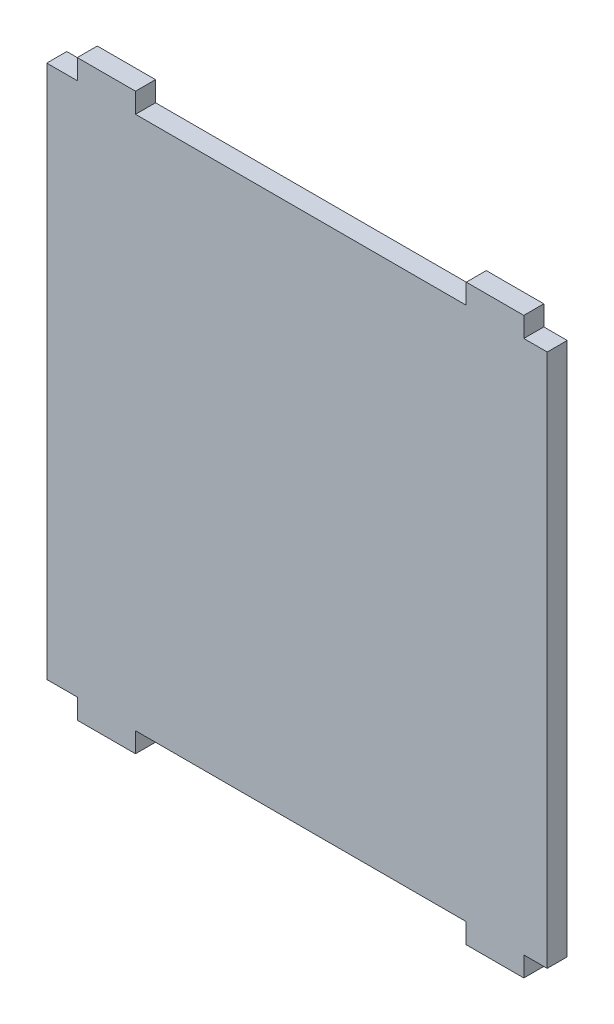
ISO-10303-21;
HEADER;
FILE_DESCRIPTION(('STEP AP214'),'2;1');
FILE_NAME('part.step','',(''),(''),'','','');
FILE_SCHEMA(('AUTOMOTIVE_DESIGN { 1 0 10303 214 1 1 1 1 }'));
ENDSEC;
DATA;
#1=APPLICATION_CONTEXT('core data for automotive mechanical design processes');
#2=APPLICATION_PROTOCOL_DEFINITION('international standard','automotive_design',2000,#1);
#3=PRODUCT_CONTEXT('',#1,'mechanical');
#4=PRODUCT('Part','Part','',(#3));
#5=PRODUCT_RELATED_PRODUCT_CATEGORY('part','',(#4));
#6=PRODUCT_DEFINITION_FORMATION('','',#4);
#7=PRODUCT_DEFINITION_CONTEXT('part definition',#1,'design');
#8=PRODUCT_DEFINITION('design','',#6,#7);
#9=PRODUCT_DEFINITION_SHAPE('','',#8);
#10=(LENGTH_UNIT() NAMED_UNIT(*) SI_UNIT(.MILLI.,.METRE.));
#11=(NAMED_UNIT(*) PLANE_ANGLE_UNIT() SI_UNIT($,.RADIAN.));
#12=(NAMED_UNIT(*) SI_UNIT($,.STERADIAN.) SOLID_ANGLE_UNIT());
#13=UNCERTAINTY_MEASURE_WITH_UNIT(LENGTH_MEASURE(1.E-05),#10,'distance_accuracy_value','');
#14=(GEOMETRIC_REPRESENTATION_CONTEXT(3) GLOBAL_UNCERTAINTY_ASSIGNED_CONTEXT((#13)) GLOBAL_UNIT_ASSIGNED_CONTEXT((#10,
#11,#12)) REPRESENTATION_CONTEXT('',''));
#15=CARTESIAN_POINT('',(0.,0.,0.));
#16=DIRECTION('',(0.,0.,1.));
#17=DIRECTION('',(1.,0.,0.));
#18=AXIS2_PLACEMENT_3D('',#15,#16,#17);
#19=CARTESIAN_POINT('',(-56.9043855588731,80.,3.));
#20=DIRECTION('',(0.,-1.,0.));
#21=DIRECTION('',(0.,0.,-1.));
#22=AXIS2_PLACEMENT_3D('',#19,#20,#21);
#23=PLANE('',#22);
#24=DIRECTION('',(-1.,0.,0.));
#25=VECTOR('',#24,1.);
#26=CARTESIAN_POINT('',(-56.9043855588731,80.,3.));
#27=LINE('',#26,#25);
#28=CARTESIAN_POINT('',(-52.3332008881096,80.,3.));
#29=VERTEX_POINT('',#28);
#30=CARTESIAN_POINT('',(-56.9043855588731,80.,3.));
#31=VERTEX_POINT('',#30);
#32=EDGE_CURVE('E37',#29,#31,#27,.T.);
#33=ORIENTED_EDGE('',*,*,#32,.F.);
#34=DIRECTION('',(0.,0.,1.));
#35=VECTOR('',#34,1.);
#36=CARTESIAN_POINT('',(-52.3332008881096,80.,0.));
#37=LINE('',#36,#35);
#38=CARTESIAN_POINT('',(-52.3332008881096,80.,0.));
#39=VERTEX_POINT('',#38);
#40=EDGE_CURVE('E206',#39,#29,#37,.T.);
#41=ORIENTED_EDGE('',*,*,#40,.F.);
#42=DIRECTION('',(-1.,0.,0.));
#43=VECTOR('',#42,1.);
#44=CARTESIAN_POINT('',(-56.9043855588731,80.,0.));
#45=LINE('',#44,#43);
#46=CARTESIAN_POINT('',(-56.9043855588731,80.,0.));
#47=VERTEX_POINT('',#46);
#48=EDGE_CURVE('E238',#39,#47,#45,.T.);
#49=ORIENTED_EDGE('',*,*,#48,.T.);
#50=DIRECTION('',(0.,0.,-1.));
#51=VECTOR('',#50,1.);
#52=CARTESIAN_POINT('',(-56.9043855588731,80.,3.));
#53=LINE('',#52,#51);
#54=EDGE_CURVE('E246',#31,#47,#53,.T.);
#55=ORIENTED_EDGE('',*,*,#54,.F.);
#56=EDGE_LOOP('',(#33,#41,#49,#55));
#57=FACE_BOUND('',#56,.T.);
#58=ADVANCED_FACE('F33',(#57),#23,.F.);
#59=CARTESIAN_POINT('',(5.96066823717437,80.,0.));
#60=VERTEX_POINT('',#59);
#61=CARTESIAN_POINT('',(-43.6048370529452,80.,0.));
#62=VERTEX_POINT('',#61);
#63=EDGE_CURVE('E240',#60,#62,#45,.T.);
#64=ORIENTED_EDGE('',*,*,#63,.T.);
#65=DIRECTION('',(0.,0.,1.));
#66=VECTOR('',#65,1.);
#67=CARTESIAN_POINT('',(-43.6048370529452,80.,0.));
#68=LINE('',#67,#66);
#69=CARTESIAN_POINT('',(-43.6048370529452,80.,3.));
#70=VERTEX_POINT('',#69);
#71=EDGE_CURVE('E58',#62,#70,#68,.T.);
#72=ORIENTED_EDGE('',*,*,#71,.T.);
#73=CARTESIAN_POINT('',(5.96066823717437,80.,3.));
#74=VERTEX_POINT('',#73);
#75=EDGE_CURVE('E290',#74,#70,#27,.T.);
#76=ORIENTED_EDGE('',*,*,#75,.F.);
#77=DIRECTION('',(0.,0.,1.));
#78=VECTOR('',#77,1.);
#79=CARTESIAN_POINT('',(5.96066823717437,80.,0.));
#80=LINE('',#79,#78);
#81=EDGE_CURVE('E225',#60,#74,#80,.T.);
#82=ORIENTED_EDGE('',*,*,#81,.F.);
#83=EDGE_LOOP('',(#64,#72,#76,#82));
#84=FACE_BOUND('',#83,.T.);
#85=ADVANCED_FACE('F433',(#84),#23,.F.);
#86=CARTESIAN_POINT('',(-56.9043855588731,0.,3.));
#87=DIRECTION('',(0.,1.,0.));
#88=DIRECTION('',(0.,0.,1.));
#89=AXIS2_PLACEMENT_3D('',#86,#87,#88);
#90=PLANE('',#89);
#91=DIRECTION('',(1.,0.,0.));
#92=VECTOR('',#91,1.);
#93=CARTESIAN_POINT('',(-56.9043855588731,0.,0.));
#94=LINE('',#93,#92);
#95=CARTESIAN_POINT('',(-43.6048370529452,0.,0.));
#96=VERTEX_POINT('',#95);
#97=CARTESIAN_POINT('',(5.96066823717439,0.,0.));
#98=VERTEX_POINT('',#97);
#99=EDGE_CURVE('E276',#96,#98,#94,.T.);
#100=ORIENTED_EDGE('',*,*,#99,.T.);
#101=DIRECTION('',(0.,0.,1.));
#102=VECTOR('',#101,1.);
#103=CARTESIAN_POINT('',(5.96066823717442,0.,0.));
#104=LINE('',#103,#102);
#105=CARTESIAN_POINT('',(5.96066823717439,0.,3.));
#106=VERTEX_POINT('',#105);
#107=EDGE_CURVE('E341',#98,#106,#104,.T.);
#108=ORIENTED_EDGE('',*,*,#107,.T.);
#109=DIRECTION('',(1.,0.,0.));
#110=VECTOR('',#109,1.);
#111=CARTESIAN_POINT('',(-56.9043855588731,0.,3.));
#112=LINE('',#111,#110);
#113=CARTESIAN_POINT('',(-43.6048370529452,0.,3.));
#114=VERTEX_POINT('',#113);
#115=EDGE_CURVE('E260',#114,#106,#112,.T.);
#116=ORIENTED_EDGE('',*,*,#115,.F.);
#117=DIRECTION('',(0.,0.,1.));
#118=VECTOR('',#117,1.);
#119=CARTESIAN_POINT('',(-43.6048370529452,0.,0.));
#120=LINE('',#119,#118);
#121=EDGE_CURVE('E367',#96,#114,#120,.T.);
#122=ORIENTED_EDGE('',*,*,#121,.F.);
#123=EDGE_LOOP('',(#100,#108,#116,#122));
#124=FACE_BOUND('',#123,.T.);
#125=ADVANCED_FACE('F390',(#124),#90,.F.);
#126=CARTESIAN_POINT('',(14.5842551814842,0.,3.));
#127=VERTEX_POINT('',#126);
#128=CARTESIAN_POINT('',(18.095309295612,0.,3.));
#129=VERTEX_POINT('',#128);
#130=EDGE_CURVE('E257',#127,#129,#112,.T.);
#131=ORIENTED_EDGE('',*,*,#130,.F.);
#132=DIRECTION('',(0.,0.,1.));
#133=VECTOR('',#132,1.);
#134=CARTESIAN_POINT('',(14.5842551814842,0.,0.));
#135=LINE('',#134,#133);
#136=CARTESIAN_POINT('',(14.5842551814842,0.,0.));
#137=VERTEX_POINT('',#136);
#138=EDGE_CURVE('E344',#137,#127,#135,.T.);
#139=ORIENTED_EDGE('',*,*,#138,.F.);
#140=CARTESIAN_POINT('',(18.095309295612,0.,0.));
#141=VERTEX_POINT('',#140);
#142=EDGE_CURVE('E261',#137,#141,#94,.T.);
#143=ORIENTED_EDGE('',*,*,#142,.T.);
#144=DIRECTION('',(0.,0.,-1.));
#145=VECTOR('',#144,1.);
#146=CARTESIAN_POINT('',(18.095309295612,0.,3.));
#147=LINE('',#146,#145);
#148=EDGE_CURVE('E43',#129,#141,#147,.T.);
#149=ORIENTED_EDGE('',*,*,#148,.F.);
#150=EDGE_LOOP('',(#131,#139,#143,#149));
#151=FACE_BOUND('',#150,.T.);
#152=ADVANCED_FACE('F407',(#151),#90,.F.);
#153=CARTESIAN_POINT('',(-56.9043855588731,80.,3.));
#154=DIRECTION('',(1.,0.,0.));
#155=DIRECTION('',(0.,0.,-1.));
#156=AXIS2_PLACEMENT_3D('',#153,#154,#155);
#157=PLANE('',#156);
#158=DIRECTION('',(0.,-1.,0.));
#159=VECTOR('',#158,1.);
#160=CARTESIAN_POINT('',(-56.9043855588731,80.,0.));
#161=LINE('',#160,#159);
#162=CARTESIAN_POINT('',(-56.9043855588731,0.,0.));
#163=VERTEX_POINT('',#162);
#164=EDGE_CURVE('E281',#47,#163,#161,.T.);
#165=ORIENTED_EDGE('',*,*,#164,.T.);
#166=DIRECTION('',(0.,0.,-1.));
#167=VECTOR('',#166,1.);
#168=CARTESIAN_POINT('',(-56.9043855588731,0.,3.));
#169=LINE('',#168,#167);
#170=CARTESIAN_POINT('',(-56.9043855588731,0.,3.));
#171=VERTEX_POINT('',#170);
#172=EDGE_CURVE('E11',#171,#163,#169,.T.);
#173=ORIENTED_EDGE('',*,*,#172,.F.);
#174=DIRECTION('',(0.,-1.,0.));
#175=VECTOR('',#174,1.);
#176=CARTESIAN_POINT('',(-56.9043855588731,80.,3.));
#177=LINE('',#176,#175);
#178=EDGE_CURVE('E256',#31,#171,#177,.T.);
#179=ORIENTED_EDGE('',*,*,#178,.F.);
#180=ORIENTED_EDGE('',*,*,#54,.T.);
#181=EDGE_LOOP('',(#165,#173,#179,#180));
#182=FACE_BOUND('',#181,.T.);
#183=ADVANCED_FACE('F35',(#182),#157,.F.);
#184=CARTESIAN_POINT('',(-52.3332008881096,0.,0.));
#185=VERTEX_POINT('',#184);
#186=EDGE_CURVE('E278',#163,#185,#94,.T.);
#187=ORIENTED_EDGE('',*,*,#186,.T.);
#188=DIRECTION('',(0.,0.,1.));
#189=VECTOR('',#188,1.);
#190=CARTESIAN_POINT('',(-52.3332008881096,0.,0.));
#191=LINE('',#190,#189);
#192=CARTESIAN_POINT('',(-52.3332008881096,0.,3.));
#193=VERTEX_POINT('',#192);
#194=EDGE_CURVE('E285',#185,#193,#191,.T.);
#195=ORIENTED_EDGE('',*,*,#194,.T.);
#196=EDGE_CURVE('E273',#171,#193,#112,.T.);
#197=ORIENTED_EDGE('',*,*,#196,.F.);
#198=ORIENTED_EDGE('',*,*,#172,.T.);
#199=EDGE_LOOP('',(#187,#195,#197,#198));
#200=FACE_BOUND('',#199,.T.);
#201=ADVANCED_FACE('F411',(#200),#90,.F.);
#202=CARTESIAN_POINT('',(18.095309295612,80.,3.));
#203=DIRECTION('',(-1.,0.,0.));
#204=DIRECTION('',(0.,-1.,0.));
#205=AXIS2_PLACEMENT_3D('',#202,#203,#204);
#206=PLANE('',#205);
#207=DIRECTION('',(0.,1.,0.));
#208=VECTOR('',#207,1.);
#209=CARTESIAN_POINT('',(18.095309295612,80.,0.));
#210=LINE('',#209,#208);
#211=CARTESIAN_POINT('',(18.095309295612,80.,0.));
#212=VERTEX_POINT('',#211);
#213=EDGE_CURVE('E241',#141,#212,#210,.T.);
#214=ORIENTED_EDGE('',*,*,#213,.T.);
#215=DIRECTION('',(0.,0.,-1.));
#216=VECTOR('',#215,1.);
#217=CARTESIAN_POINT('',(18.095309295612,80.,3.));
#218=LINE('',#217,#216);
#219=CARTESIAN_POINT('',(18.095309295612,80.,3.));
#220=VERTEX_POINT('',#219);
#221=EDGE_CURVE('E298',#220,#212,#218,.T.);
#222=ORIENTED_EDGE('',*,*,#221,.F.);
#223=DIRECTION('',(0.,1.,0.));
#224=VECTOR('',#223,1.);
#225=CARTESIAN_POINT('',(18.095309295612,80.,3.));
#226=LINE('',#225,#224);
#227=EDGE_CURVE('E267',#129,#220,#226,.T.);
#228=ORIENTED_EDGE('',*,*,#227,.F.);
#229=ORIENTED_EDGE('',*,*,#148,.T.);
#230=EDGE_LOOP('',(#214,#222,#228,#229));
#231=FACE_BOUND('',#230,.T.);
#232=ADVANCED_FACE('F308',(#231),#206,.F.);
#233=CARTESIAN_POINT('',(14.5842551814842,80.,0.));
#234=VERTEX_POINT('',#233);
#235=EDGE_CURVE('E253',#212,#234,#45,.T.);
#236=ORIENTED_EDGE('',*,*,#235,.T.);
#237=DIRECTION('',(0.,0.,1.));
#238=VECTOR('',#237,1.);
#239=CARTESIAN_POINT('',(14.5842551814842,80.,0.));
#240=LINE('',#239,#238);
#241=CARTESIAN_POINT('',(14.5842551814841,80.,3.));
#242=VERTEX_POINT('',#241);
#243=EDGE_CURVE('E232',#234,#242,#240,.T.);
#244=ORIENTED_EDGE('',*,*,#243,.T.);
#245=EDGE_CURVE('E292',#220,#242,#27,.T.);
#246=ORIENTED_EDGE('',*,*,#245,.F.);
#247=ORIENTED_EDGE('',*,*,#221,.T.);
#248=EDGE_LOOP('',(#236,#244,#246,#247));
#249=FACE_BOUND('',#248,.T.);
#250=ADVANCED_FACE('F313',(#249),#23,.F.);
#251=CARTESIAN_POINT('',(0.,0.,3.));
#252=DIRECTION('',(0.,0.,1.));
#253=DIRECTION('',(1.,0.,0.));
#254=AXIS2_PLACEMENT_3D('',#251,#252,#253);
#255=PLANE('',#254);
#256=ORIENTED_EDGE('',*,*,#178,.T.);
#257=ORIENTED_EDGE('',*,*,#196,.T.);
#258=DIRECTION('',(0.,-1.,0.));
#259=VECTOR('',#258,1.);
#260=CARTESIAN_POINT('',(-52.3332008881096,0.,3.));
#261=LINE('',#260,#259);
#262=CARTESIAN_POINT('',(-52.3332008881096,-3.,3.));
#263=VERTEX_POINT('',#262);
#264=EDGE_CURVE('E343',#193,#263,#261,.T.);
#265=ORIENTED_EDGE('',*,*,#264,.T.);
#266=DIRECTION('',(1.,0.,0.));
#267=VECTOR('',#266,1.);
#268=CARTESIAN_POINT('',(-52.3332008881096,-3.,3.));
#269=LINE('',#268,#267);
#270=CARTESIAN_POINT('',(-43.6048370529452,-3.,3.));
#271=VERTEX_POINT('',#270);
#272=EDGE_CURVE('E355',#263,#271,#269,.T.);
#273=ORIENTED_EDGE('',*,*,#272,.T.);
#274=DIRECTION('',(0.,1.,0.));
#275=VECTOR('',#274,1.);
#276=CARTESIAN_POINT('',(-43.6048370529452,0.,3.));
#277=LINE('',#276,#275);
#278=EDGE_CURVE('E358',#271,#114,#277,.T.);
#279=ORIENTED_EDGE('',*,*,#278,.T.);
#280=ORIENTED_EDGE('',*,*,#115,.T.);
#281=DIRECTION('',(0.,-1.,0.));
#282=VECTOR('',#281,1.);
#283=CARTESIAN_POINT('',(5.96066823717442,0.,3.));
#284=LINE('',#283,#282);
#285=CARTESIAN_POINT('',(5.96066823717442,-3.,3.));
#286=VERTEX_POINT('',#285);
#287=EDGE_CURVE('E228',#106,#286,#284,.T.);
#288=ORIENTED_EDGE('',*,*,#287,.T.);
#289=DIRECTION('',(1.,0.,0.));
#290=VECTOR('',#289,1.);
#291=CARTESIAN_POINT('',(5.96066823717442,-3.,3.));
#292=LINE('',#291,#290);
#293=CARTESIAN_POINT('',(14.5842551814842,-3.,3.));
#294=VERTEX_POINT('',#293);
#295=EDGE_CURVE('E337',#286,#294,#292,.T.);
#296=ORIENTED_EDGE('',*,*,#295,.T.);
#297=DIRECTION('',(0.,1.,0.));
#298=VECTOR('',#297,1.);
#299=CARTESIAN_POINT('',(14.5842551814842,0.,3.));
#300=LINE('',#299,#298);
#301=EDGE_CURVE('E328',#294,#127,#300,.T.);
#302=ORIENTED_EDGE('',*,*,#301,.T.);
#303=ORIENTED_EDGE('',*,*,#130,.T.);
#304=ORIENTED_EDGE('',*,*,#227,.T.);
#305=ORIENTED_EDGE('',*,*,#245,.T.);
#306=DIRECTION('',(0.,1.,0.));
#307=VECTOR('',#306,1.);
#308=CARTESIAN_POINT('',(14.5842551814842,80.,3.));
#309=LINE('',#308,#307);
#310=CARTESIAN_POINT('',(14.5842551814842,83.,3.));
#311=VERTEX_POINT('',#310);
#312=EDGE_CURVE('E208',#242,#311,#309,.T.);
#313=ORIENTED_EDGE('',*,*,#312,.T.);
#314=DIRECTION('',(-1.,0.,0.));
#315=VECTOR('',#314,1.);
#316=CARTESIAN_POINT('',(5.96066823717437,83.,3.));
#317=LINE('',#316,#315);
#318=CARTESIAN_POINT('',(5.96066823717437,83.,3.));
#319=VERTEX_POINT('',#318);
#320=EDGE_CURVE('E216',#311,#319,#317,.T.);
#321=ORIENTED_EDGE('',*,*,#320,.T.);
#322=DIRECTION('',(0.,-1.,0.));
#323=VECTOR('',#322,1.);
#324=CARTESIAN_POINT('',(5.96066823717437,80.,3.));
#325=LINE('',#324,#323);
#326=EDGE_CURVE('E219',#319,#74,#325,.T.);
#327=ORIENTED_EDGE('',*,*,#326,.T.);
#328=ORIENTED_EDGE('',*,*,#75,.T.);
#329=DIRECTION('',(0.,1.,0.));
#330=VECTOR('',#329,1.);
#331=CARTESIAN_POINT('',(-43.6048370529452,80.,3.));
#332=LINE('',#331,#330);
#333=CARTESIAN_POINT('',(-43.6048370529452,83.,3.));
#334=VERTEX_POINT('',#333);
#335=EDGE_CURVE('E203',#70,#334,#332,.T.);
#336=ORIENTED_EDGE('',*,*,#335,.T.);
#337=DIRECTION('',(-1.,0.,0.));
#338=VECTOR('',#337,1.);
#339=CARTESIAN_POINT('',(-52.3332008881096,83.,3.));
#340=LINE('',#339,#338);
#341=CARTESIAN_POINT('',(-52.3332008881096,83.,3.));
#342=VERTEX_POINT('',#341);
#343=EDGE_CURVE('E180',#334,#342,#340,.T.);
#344=ORIENTED_EDGE('',*,*,#343,.T.);
#345=DIRECTION('',(0.,-1.,0.));
#346=VECTOR('',#345,1.);
#347=CARTESIAN_POINT('',(-52.3332008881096,80.,3.));
#348=LINE('',#347,#346);
#349=EDGE_CURVE('E197',#342,#29,#348,.T.);
#350=ORIENTED_EDGE('',*,*,#349,.T.);
#351=ORIENTED_EDGE('',*,*,#32,.T.);
#352=EDGE_LOOP('',(#256,#257,#265,#273,#279,#280,#288,#296,#302,#303,#304,#305,#313,#321,#327,
#328,#336,#344,#350,#351));
#353=FACE_BOUND('',#352,.T.);
#354=ADVANCED_FACE('F302',(#353),#255,.T.);
#355=CARTESIAN_POINT('',(0.,0.,0.));
#356=DIRECTION('',(0.,0.,1.));
#357=DIRECTION('',(1.,0.,0.));
#358=AXIS2_PLACEMENT_3D('',#355,#356,#357);
#359=PLANE('',#358);
#360=ORIENTED_EDGE('',*,*,#164,.F.);
#361=ORIENTED_EDGE('',*,*,#48,.F.);
#362=DIRECTION('',(0.,-1.,0.));
#363=VECTOR('',#362,1.);
#364=CARTESIAN_POINT('',(-52.3332008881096,80.,0.));
#365=LINE('',#364,#363);
#366=CARTESIAN_POINT('',(-52.3332008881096,83.,0.));
#367=VERTEX_POINT('',#366);
#368=EDGE_CURVE('E194',#367,#39,#365,.T.);
#369=ORIENTED_EDGE('',*,*,#368,.F.);
#370=DIRECTION('',(-1.,0.,0.));
#371=VECTOR('',#370,1.);
#372=CARTESIAN_POINT('',(-52.3332008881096,83.,0.));
#373=LINE('',#372,#371);
#374=CARTESIAN_POINT('',(-43.6048370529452,83.,0.));
#375=VERTEX_POINT('',#374);
#376=EDGE_CURVE('E177',#375,#367,#373,.T.);
#377=ORIENTED_EDGE('',*,*,#376,.F.);
#378=DIRECTION('',(0.,1.,0.));
#379=VECTOR('',#378,1.);
#380=CARTESIAN_POINT('',(-43.6048370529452,80.,0.));
#381=LINE('',#380,#379);
#382=EDGE_CURVE('E192',#62,#375,#381,.T.);
#383=ORIENTED_EDGE('',*,*,#382,.F.);
#384=ORIENTED_EDGE('',*,*,#63,.F.);
#385=DIRECTION('',(0.,-1.,0.));
#386=VECTOR('',#385,1.);
#387=CARTESIAN_POINT('',(5.96066823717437,80.,0.));
#388=LINE('',#387,#386);
#389=CARTESIAN_POINT('',(5.96066823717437,83.,0.));
#390=VERTEX_POINT('',#389);
#391=EDGE_CURVE('E214',#390,#60,#388,.T.);
#392=ORIENTED_EDGE('',*,*,#391,.F.);
#393=DIRECTION('',(-1.,0.,0.));
#394=VECTOR('',#393,1.);
#395=CARTESIAN_POINT('',(5.96066823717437,83.,0.));
#396=LINE('',#395,#394);
#397=CARTESIAN_POINT('',(14.5842551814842,83.,0.));
#398=VERTEX_POINT('',#397);
#399=EDGE_CURVE('E211',#398,#390,#396,.T.);
#400=ORIENTED_EDGE('',*,*,#399,.F.);
#401=DIRECTION('',(0.,1.,0.));
#402=VECTOR('',#401,1.);
#403=CARTESIAN_POINT('',(14.5842551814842,80.,0.));
#404=LINE('',#403,#402);
#405=EDGE_CURVE('E215',#234,#398,#404,.T.);
#406=ORIENTED_EDGE('',*,*,#405,.F.);
#407=ORIENTED_EDGE('',*,*,#235,.F.);
#408=ORIENTED_EDGE('',*,*,#213,.F.);
#409=ORIENTED_EDGE('',*,*,#142,.F.);
#410=DIRECTION('',(0.,1.,0.));
#411=VECTOR('',#410,1.);
#412=CARTESIAN_POINT('',(14.5842551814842,0.,0.));
#413=LINE('',#412,#411);
#414=CARTESIAN_POINT('',(14.5842551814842,-3.,0.));
#415=VERTEX_POINT('',#414);
#416=EDGE_CURVE('E331',#415,#137,#413,.T.);
#417=ORIENTED_EDGE('',*,*,#416,.F.);
#418=DIRECTION('',(1.,0.,0.));
#419=VECTOR('',#418,1.);
#420=CARTESIAN_POINT('',(5.96066823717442,-3.,0.));
#421=LINE('',#420,#419);
#422=CARTESIAN_POINT('',(5.96066823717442,-3.,0.));
#423=VERTEX_POINT('',#422);
#424=EDGE_CURVE('E327',#423,#415,#421,.T.);
#425=ORIENTED_EDGE('',*,*,#424,.F.);
#426=DIRECTION('',(0.,-1.,0.));
#427=VECTOR('',#426,1.);
#428=CARTESIAN_POINT('',(5.96066823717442,0.,0.));
#429=LINE('',#428,#427);
#430=EDGE_CURVE('E324',#98,#423,#429,.T.);
#431=ORIENTED_EDGE('',*,*,#430,.F.);
#432=ORIENTED_EDGE('',*,*,#99,.F.);
#433=DIRECTION('',(0.,1.,0.));
#434=VECTOR('',#433,1.);
#435=CARTESIAN_POINT('',(-43.6048370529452,0.,0.));
#436=LINE('',#435,#434);
#437=CARTESIAN_POINT('',(-43.6048370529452,-3.,0.));
#438=VERTEX_POINT('',#437);
#439=EDGE_CURVE('E353',#438,#96,#436,.T.);
#440=ORIENTED_EDGE('',*,*,#439,.F.);
#441=DIRECTION('',(1.,0.,0.));
#442=VECTOR('',#441,1.);
#443=CARTESIAN_POINT('',(-52.3332008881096,-3.,0.));
#444=LINE('',#443,#442);
#445=CARTESIAN_POINT('',(-52.3332008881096,-3.,0.));
#446=VERTEX_POINT('',#445);
#447=EDGE_CURVE('E350',#446,#438,#444,.T.);
#448=ORIENTED_EDGE('',*,*,#447,.F.);
#449=DIRECTION('',(0.,-1.,0.));
#450=VECTOR('',#449,1.);
#451=CARTESIAN_POINT('',(-52.3332008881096,0.,0.));
#452=LINE('',#451,#450);
#453=EDGE_CURVE('E354',#185,#446,#452,.T.);
#454=ORIENTED_EDGE('',*,*,#453,.F.);
#455=ORIENTED_EDGE('',*,*,#186,.F.);
#456=EDGE_LOOP('',(#360,#361,#369,#377,#383,#384,#392,#400,#406,#407,#408,#409,#417,#425,#431,
#432,#440,#448,#454,#455));
#457=FACE_BOUND('',#456,.T.);
#458=ADVANCED_FACE('F190',(#457),#359,.F.);
#459=CARTESIAN_POINT('',(-52.3332008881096,0.,0.));
#460=DIRECTION('',(-1.,0.,0.));
#461=DIRECTION('',(0.,0.,1.));
#462=AXIS2_PLACEMENT_3D('',#459,#460,#461);
#463=PLANE('',#462);
#464=ORIENTED_EDGE('',*,*,#264,.F.);
#465=ORIENTED_EDGE('',*,*,#194,.F.);
#466=ORIENTED_EDGE('',*,*,#453,.T.);
#467=DIRECTION('',(0.,0.,1.));
#468=VECTOR('',#467,1.);
#469=CARTESIAN_POINT('',(-52.3332008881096,-3.,0.));
#470=LINE('',#469,#468);
#471=EDGE_CURVE('E376',#446,#263,#470,.T.);
#472=ORIENTED_EDGE('',*,*,#471,.T.);
#473=EDGE_LOOP('',(#464,#465,#466,#472));
#474=FACE_BOUND('',#473,.T.);
#475=ADVANCED_FACE('F416',(#474),#463,.T.);
#476=CARTESIAN_POINT('',(-43.6048370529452,0.,0.));
#477=DIRECTION('',(1.,0.,0.));
#478=DIRECTION('',(0.,0.,-1.));
#479=AXIS2_PLACEMENT_3D('',#476,#477,#478);
#480=PLANE('',#479);
#481=ORIENTED_EDGE('',*,*,#278,.F.);
#482=DIRECTION('',(0.,0.,1.));
#483=VECTOR('',#482,1.);
#484=CARTESIAN_POINT('',(-43.6048370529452,-3.,0.));
#485=LINE('',#484,#483);
#486=EDGE_CURVE('E374',#438,#271,#485,.T.);
#487=ORIENTED_EDGE('',*,*,#486,.F.);
#488=ORIENTED_EDGE('',*,*,#439,.T.);
#489=ORIENTED_EDGE('',*,*,#121,.T.);
#490=EDGE_LOOP('',(#481,#487,#488,#489));
#491=FACE_BOUND('',#490,.T.);
#492=ADVANCED_FACE('F526',(#491),#480,.T.);
#493=CARTESIAN_POINT('',(-52.3332008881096,-3.,0.));
#494=DIRECTION('',(0.,-1.,0.));
#495=DIRECTION('',(0.,0.,-1.));
#496=AXIS2_PLACEMENT_3D('',#493,#494,#495);
#497=PLANE('',#496);
#498=ORIENTED_EDGE('',*,*,#272,.F.);
#499=ORIENTED_EDGE('',*,*,#471,.F.);
#500=ORIENTED_EDGE('',*,*,#447,.T.);
#501=ORIENTED_EDGE('',*,*,#486,.T.);
#502=EDGE_LOOP('',(#498,#499,#500,#501));
#503=FACE_BOUND('',#502,.T.);
#504=ADVANCED_FACE('F535',(#503),#497,.T.);
#505=CARTESIAN_POINT('',(5.96066823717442,0.,0.));
#506=DIRECTION('',(-1.,0.,0.));
#507=DIRECTION('',(0.,0.,1.));
#508=AXIS2_PLACEMENT_3D('',#505,#506,#507);
#509=PLANE('',#508);
#510=ORIENTED_EDGE('',*,*,#287,.F.);
#511=ORIENTED_EDGE('',*,*,#107,.F.);
#512=ORIENTED_EDGE('',*,*,#430,.T.);
#513=DIRECTION('',(0.,0.,1.));
#514=VECTOR('',#513,1.);
#515=CARTESIAN_POINT('',(5.96066823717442,-3.,0.));
#516=LINE('',#515,#514);
#517=EDGE_CURVE('E334',#423,#286,#516,.T.);
#518=ORIENTED_EDGE('',*,*,#517,.T.);
#519=EDGE_LOOP('',(#510,#511,#512,#518));
#520=FACE_BOUND('',#519,.T.);
#521=ADVANCED_FACE('F395',(#520),#509,.T.);
#522=CARTESIAN_POINT('',(14.5842551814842,0.,0.));
#523=DIRECTION('',(1.,0.,0.));
#524=DIRECTION('',(0.,0.,-1.));
#525=AXIS2_PLACEMENT_3D('',#522,#523,#524);
#526=PLANE('',#525);
#527=ORIENTED_EDGE('',*,*,#301,.F.);
#528=DIRECTION('',(0.,0.,1.));
#529=VECTOR('',#528,1.);
#530=CARTESIAN_POINT('',(14.5842551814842,-3.,0.));
#531=LINE('',#530,#529);
#532=EDGE_CURVE('E347',#415,#294,#531,.T.);
#533=ORIENTED_EDGE('',*,*,#532,.F.);
#534=ORIENTED_EDGE('',*,*,#416,.T.);
#535=ORIENTED_EDGE('',*,*,#138,.T.);
#536=EDGE_LOOP('',(#527,#533,#534,#535));
#537=FACE_BOUND('',#536,.T.);
#538=ADVANCED_FACE('F404',(#537),#526,.T.);
#539=CARTESIAN_POINT('',(5.96066823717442,-3.,0.));
#540=DIRECTION('',(0.,-1.,0.));
#541=DIRECTION('',(0.,0.,-1.));
#542=AXIS2_PLACEMENT_3D('',#539,#540,#541);
#543=PLANE('',#542);
#544=ORIENTED_EDGE('',*,*,#295,.F.);
#545=ORIENTED_EDGE('',*,*,#517,.F.);
#546=ORIENTED_EDGE('',*,*,#424,.T.);
#547=ORIENTED_EDGE('',*,*,#532,.T.);
#548=EDGE_LOOP('',(#544,#545,#546,#547));
#549=FACE_BOUND('',#548,.T.);
#550=ADVANCED_FACE('F401',(#549),#543,.T.);
#551=CARTESIAN_POINT('',(5.96066823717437,80.,0.));
#552=DIRECTION('',(-1.,0.,0.));
#553=DIRECTION('',(0.,0.,1.));
#554=AXIS2_PLACEMENT_3D('',#551,#552,#553);
#555=PLANE('',#554);
#556=ORIENTED_EDGE('',*,*,#326,.F.);
#557=DIRECTION('',(0.,0.,1.));
#558=VECTOR('',#557,1.);
#559=CARTESIAN_POINT('',(5.96066823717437,83.,0.));
#560=LINE('',#559,#558);
#561=EDGE_CURVE('E222',#390,#319,#560,.T.);
#562=ORIENTED_EDGE('',*,*,#561,.F.);
#563=ORIENTED_EDGE('',*,*,#391,.T.);
#564=ORIENTED_EDGE('',*,*,#81,.T.);
#565=EDGE_LOOP('',(#556,#562,#563,#564));
#566=FACE_BOUND('',#565,.T.);
#567=ADVANCED_FACE('F569',(#566),#555,.T.);
#568=CARTESIAN_POINT('',(5.96066823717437,83.,0.));
#569=DIRECTION('',(0.,1.,0.));
#570=DIRECTION('',(0.,0.,1.));
#571=AXIS2_PLACEMENT_3D('',#568,#569,#570);
#572=PLANE('',#571);
#573=ORIENTED_EDGE('',*,*,#320,.F.);
#574=DIRECTION('',(0.,0.,1.));
#575=VECTOR('',#574,1.);
#576=CARTESIAN_POINT('',(14.5842551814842,83.,0.));
#577=LINE('',#576,#575);
#578=EDGE_CURVE('E317',#398,#311,#577,.T.);
#579=ORIENTED_EDGE('',*,*,#578,.F.);
#580=ORIENTED_EDGE('',*,*,#399,.T.);
#581=ORIENTED_EDGE('',*,*,#561,.T.);
#582=EDGE_LOOP('',(#573,#579,#580,#581));
#583=FACE_BOUND('',#582,.T.);
#584=ADVANCED_FACE('F430',(#583),#572,.T.);
#585=CARTESIAN_POINT('',(14.5842551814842,80.,0.));
#586=DIRECTION('',(1.,0.,0.));
#587=DIRECTION('',(0.,0.,-1.));
#588=AXIS2_PLACEMENT_3D('',#585,#586,#587);
#589=PLANE('',#588);
#590=ORIENTED_EDGE('',*,*,#312,.F.);
#591=ORIENTED_EDGE('',*,*,#243,.F.);
#592=ORIENTED_EDGE('',*,*,#405,.T.);
#593=ORIENTED_EDGE('',*,*,#578,.T.);
#594=EDGE_LOOP('',(#590,#591,#592,#593));
#595=FACE_BOUND('',#594,.T.);
#596=ADVANCED_FACE('F423',(#595),#589,.T.);
#597=CARTESIAN_POINT('',(-52.3332008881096,80.,0.));
#598=DIRECTION('',(-1.,0.,0.));
#599=DIRECTION('',(0.,0.,1.));
#600=AXIS2_PLACEMENT_3D('',#597,#598,#599);
#601=PLANE('',#600);
#602=ORIENTED_EDGE('',*,*,#349,.F.);
#603=DIRECTION('',(0.,0.,1.));
#604=VECTOR('',#603,1.);
#605=CARTESIAN_POINT('',(-52.3332008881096,83.,0.));
#606=LINE('',#605,#604);
#607=EDGE_CURVE('E185',#367,#342,#606,.T.);
#608=ORIENTED_EDGE('',*,*,#607,.F.);
#609=ORIENTED_EDGE('',*,*,#368,.T.);
#610=ORIENTED_EDGE('',*,*,#40,.T.);
#611=EDGE_LOOP('',(#602,#608,#609,#610));
#612=FACE_BOUND('',#611,.T.);
#613=ADVANCED_FACE('F421',(#612),#601,.T.);
#614=CARTESIAN_POINT('',(-52.3332008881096,83.,0.));
#615=DIRECTION('',(0.,1.,0.));
#616=DIRECTION('',(0.,0.,1.));
#617=AXIS2_PLACEMENT_3D('',#614,#615,#616);
#618=PLANE('',#617);
#619=ORIENTED_EDGE('',*,*,#343,.F.);
#620=DIRECTION('',(0.,0.,1.));
#621=VECTOR('',#620,1.);
#622=CARTESIAN_POINT('',(-43.6048370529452,83.,0.));
#623=LINE('',#622,#621);
#624=EDGE_CURVE('E174',#375,#334,#623,.T.);
#625=ORIENTED_EDGE('',*,*,#624,.F.);
#626=ORIENTED_EDGE('',*,*,#376,.T.);
#627=ORIENTED_EDGE('',*,*,#607,.T.);
#628=EDGE_LOOP('',(#619,#625,#626,#627));
#629=FACE_BOUND('',#628,.T.);
#630=ADVANCED_FACE('F176',(#629),#618,.T.);
#631=CARTESIAN_POINT('',(-43.6048370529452,80.,0.));
#632=DIRECTION('',(1.,0.,0.));
#633=DIRECTION('',(0.,0.,-1.));
#634=AXIS2_PLACEMENT_3D('',#631,#632,#633);
#635=PLANE('',#634);
#636=ORIENTED_EDGE('',*,*,#335,.F.);
#637=ORIENTED_EDGE('',*,*,#71,.F.);
#638=ORIENTED_EDGE('',*,*,#382,.T.);
#639=ORIENTED_EDGE('',*,*,#624,.T.);
#640=EDGE_LOOP('',(#636,#637,#638,#639));
#641=FACE_BOUND('',#640,.T.);
#642=ADVANCED_FACE('F196',(#641),#635,.T.);
#643=CLOSED_SHELL('',(#58,#85,#125,#152,#183,#201,#232,#250,#354,#458,#475,#492,#504,#521,#538,
#550,#567,#584,#596,#613,#630,#642));
#644=MANIFOLD_SOLID_BREP('B2',#643);
#645=ADVANCED_BREP_SHAPE_REPRESENTATION('',(#18,#644),#14);
#646=SHAPE_DEFINITION_REPRESENTATION(#9,#645);
ENDSEC;
END-ISO-10303-21;
